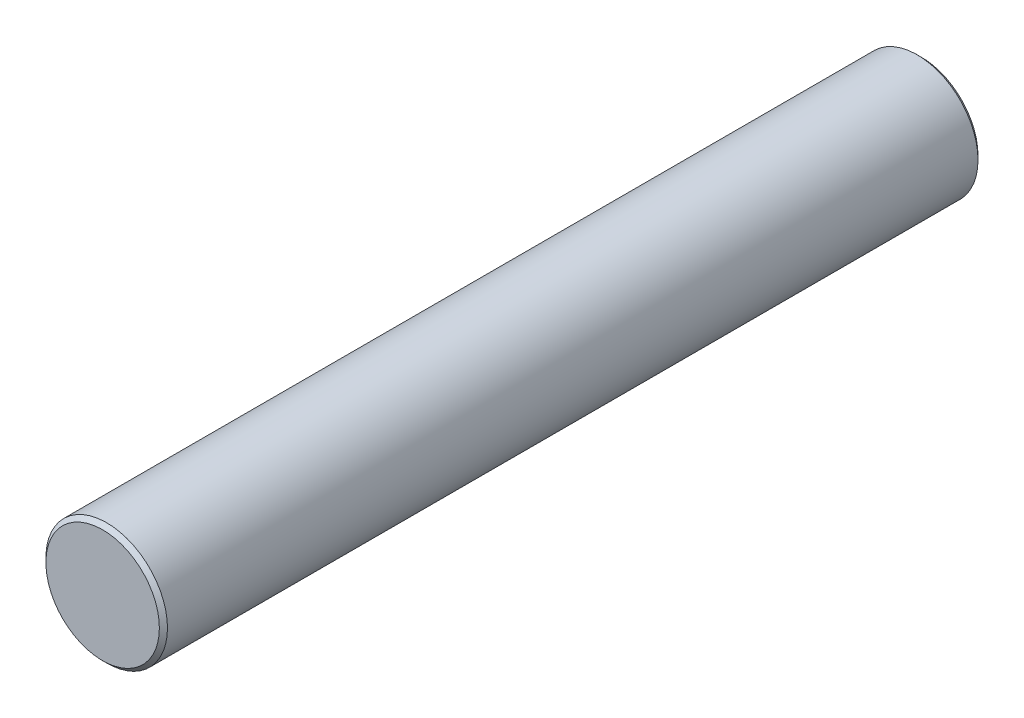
ISO-10303-21;
HEADER;
FILE_DESCRIPTION(('STEP AP214'),'2;1');
FILE_NAME('part.step','',(''),(''),'','','');
FILE_SCHEMA(('AUTOMOTIVE_DESIGN { 1 0 10303 214 1 1 1 1 }'));
ENDSEC;
DATA;
#1=APPLICATION_CONTEXT('core data for automotive mechanical design processes');
#2=APPLICATION_PROTOCOL_DEFINITION('international standard','automotive_design',2000,#1);
#3=PRODUCT_CONTEXT('',#1,'mechanical');
#4=PRODUCT('Part','Part','',(#3));
#5=PRODUCT_RELATED_PRODUCT_CATEGORY('part','',(#4));
#6=PRODUCT_DEFINITION_FORMATION('','',#4);
#7=PRODUCT_DEFINITION_CONTEXT('part definition',#1,'design');
#8=PRODUCT_DEFINITION('design','',#6,#7);
#9=PRODUCT_DEFINITION_SHAPE('','',#8);
#10=(LENGTH_UNIT() NAMED_UNIT(*) SI_UNIT(.MILLI.,.METRE.));
#11=(NAMED_UNIT(*) PLANE_ANGLE_UNIT() SI_UNIT($,.RADIAN.));
#12=(NAMED_UNIT(*) SI_UNIT($,.STERADIAN.) SOLID_ANGLE_UNIT());
#13=UNCERTAINTY_MEASURE_WITH_UNIT(LENGTH_MEASURE(1.E-05),#10,'distance_accuracy_value','');
#14=(GEOMETRIC_REPRESENTATION_CONTEXT(3) GLOBAL_UNCERTAINTY_ASSIGNED_CONTEXT((#13)) GLOBAL_UNIT_ASSIGNED_CONTEXT((#10,
#11,#12)) REPRESENTATION_CONTEXT('',''));
#15=CARTESIAN_POINT('',(0.,0.,0.));
#16=DIRECTION('',(0.,0.,1.));
#17=DIRECTION('',(1.,0.,0.));
#18=AXIS2_PLACEMENT_3D('',#15,#16,#17);
#19=CARTESIAN_POINT('',(0.,0.,202.));
#20=DIRECTION('',(0.,0.,-1.));
#21=DIRECTION('',(-1.,0.,0.));
#22=AXIS2_PLACEMENT_3D('',#19,#20,#21);
#23=CYLINDRICAL_SURFACE('',#22,15.);
#24=CARTESIAN_POINT('',(0.,0.,1.));
#25=DIRECTION('',(0.,0.,1.));
#26=DIRECTION('',(1.,0.,0.));
#27=AXIS2_PLACEMENT_3D('',#24,#25,#26);
#28=CIRCLE('',#27,15.);
#29=CARTESIAN_POINT('',(15.,0.,1.));
#30=VERTEX_POINT('',#29);
#31=EDGE_CURVE('E41',#30,#30,#28,.T.);
#32=ORIENTED_EDGE('',*,*,#31,.T.);
#33=EDGE_LOOP('',(#32));
#34=FACE_BOUND('',#33,.T.);
#35=CARTESIAN_POINT('',(0.,0.,201.));
#36=DIRECTION('',(0.,0.,1.));
#37=DIRECTION('',(1.,0.,0.));
#38=AXIS2_PLACEMENT_3D('',#35,#36,#37);
#39=CIRCLE('',#38,15.);
#40=CARTESIAN_POINT('',(15.,0.,201.));
#41=VERTEX_POINT('',#40);
#42=EDGE_CURVE('E45',#41,#41,#39,.F.);
#43=ORIENTED_EDGE('',*,*,#42,.T.);
#44=EDGE_LOOP('',(#43));
#45=FACE_BOUND('',#44,.T.);
#46=ADVANCED_FACE('F31',(#34,#45),#23,.T.);
#47=CARTESIAN_POINT('',(0.,0.,202.));
#48=DIRECTION('',(0.,0.,1.));
#49=DIRECTION('',(1.,0.,0.));
#50=AXIS2_PLACEMENT_3D('',#47,#48,#49);
#51=PLANE('',#50);
#52=CARTESIAN_POINT('',(0.,0.,202.));
#53=DIRECTION('',(0.,0.,1.));
#54=DIRECTION('',(1.,0.,0.));
#55=AXIS2_PLACEMENT_3D('',#52,#53,#54);
#56=CIRCLE('',#55,14.);
#57=CARTESIAN_POINT('',(14.,0.,202.));
#58=VERTEX_POINT('',#57);
#59=EDGE_CURVE('E10',#58,#58,#56,.T.);
#60=ORIENTED_EDGE('',*,*,#59,.T.);
#61=EDGE_LOOP('',(#60));
#62=FACE_BOUND('',#61,.T.);
#63=ADVANCED_FACE('F64',(#62),#51,.T.);
#64=CARTESIAN_POINT('',(0.,0.,0.));
#65=DIRECTION('',(0.,0.,1.));
#66=DIRECTION('',(1.,0.,0.));
#67=AXIS2_PLACEMENT_3D('',#64,#65,#66);
#68=PLANE('',#67);
#69=CARTESIAN_POINT('',(0.,0.,0.));
#70=DIRECTION('',(0.,0.,1.));
#71=DIRECTION('',(1.,0.,0.));
#72=AXIS2_PLACEMENT_3D('',#69,#70,#71);
#73=CIRCLE('',#72,14.);
#74=CARTESIAN_POINT('',(14.,0.,0.));
#75=VERTEX_POINT('',#74);
#76=EDGE_CURVE('E37',#75,#75,#73,.F.);
#77=ORIENTED_EDGE('',*,*,#76,.T.);
#78=EDGE_LOOP('',(#77));
#79=FACE_BOUND('',#78,.T.);
#80=ADVANCED_FACE('F60',(#79),#68,.F.);
#81=CARTESIAN_POINT('',(0.,0.,1.));
#82=DIRECTION('',(0.,0.,1.));
#83=DIRECTION('',(1.,0.,0.));
#84=AXIS2_PLACEMENT_3D('',#81,#82,#83);
#85=CONICAL_SURFACE('',#84,15.,0.785398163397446);
#86=ORIENTED_EDGE('',*,*,#76,.F.);
#87=EDGE_LOOP('',(#86));
#88=FACE_BOUND('',#87,.T.);
#89=ORIENTED_EDGE('',*,*,#31,.F.);
#90=EDGE_LOOP('',(#89));
#91=FACE_BOUND('',#90,.T.);
#92=ADVANCED_FACE('F55',(#88,#91),#85,.T.);
#93=CARTESIAN_POINT('',(0.,0.,202.));
#94=DIRECTION('',(0.,0.,-1.));
#95=DIRECTION('',(-1.,0.,0.));
#96=AXIS2_PLACEMENT_3D('',#93,#94,#95);
#97=CONICAL_SURFACE('',#96,14.,0.785398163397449);
#98=ORIENTED_EDGE('',*,*,#42,.F.);
#99=EDGE_LOOP('',(#98));
#100=FACE_BOUND('',#99,.T.);
#101=ORIENTED_EDGE('',*,*,#59,.F.);
#102=EDGE_LOOP('',(#101));
#103=FACE_BOUND('',#102,.T.);
#104=ADVANCED_FACE('F52',(#100,#103),#97,.T.);
#105=CLOSED_SHELL('',(#46,#63,#80,#92,#104));
#106=MANIFOLD_SOLID_BREP('B2',#105);
#107=ADVANCED_BREP_SHAPE_REPRESENTATION('',(#18,#106),#14);
#108=SHAPE_DEFINITION_REPRESENTATION(#9,#107);
ENDSEC;
END-ISO-10303-21;
